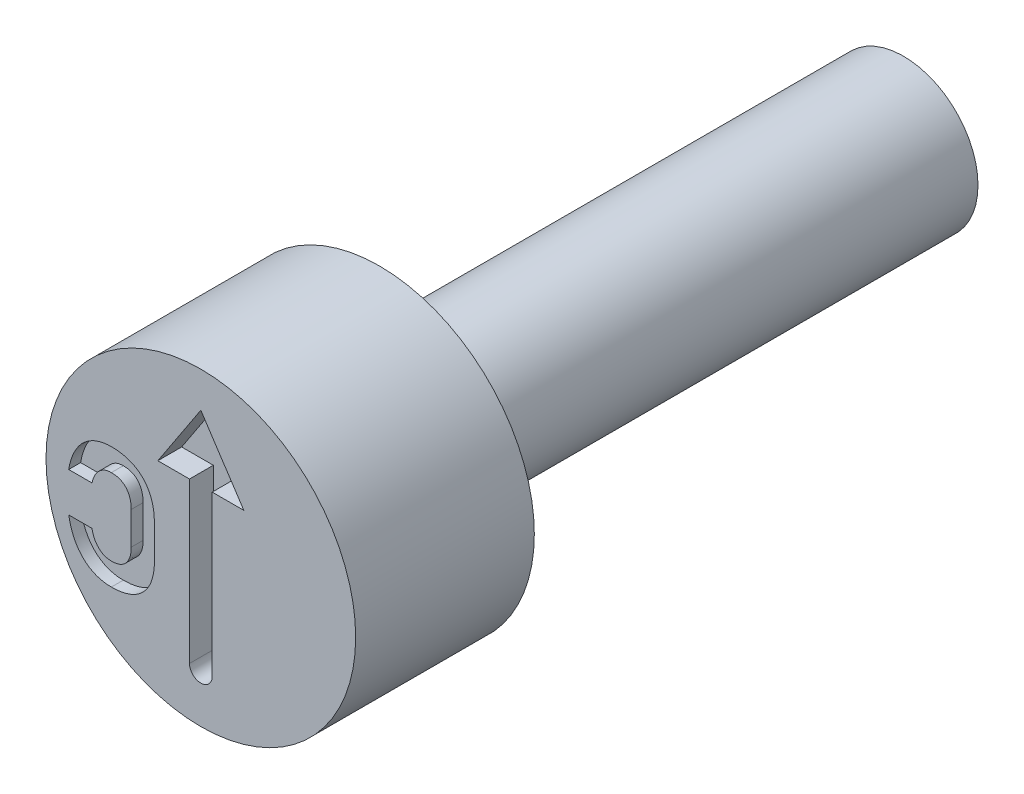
from build123d import *

# Parameters (mm, degrees)
CUT_EXTRUDE4_DEPTH = 0.4
CUT_EXTRUDE5_DEPTH = 0.2


with BuildPart() as part:
    # Sketch2 → Revolve1 (revolve)
    with BuildSketch(Plane(origin=(0, 0, 0), x_dir=(0, 0, -1), z_dir=(1, 0, 0)), mode=Mode.PRIVATE) as revolve1_sk:
        Polygon((0, 2.6), (0, 0), (11.8, 0), (11.8, 1.25), (3, 1.25), (3, 2.6), align=None)
    revolve(revolve1_sk.sketch.rotate(Axis((0, 0, -0.403888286), (0, 0, -1)), 90), axis=Axis((0, 0, -0.403888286), (0, 0, -1)))

    # Sketch3 → Cut-Extrude4 (cut)
    with BuildSketch(Plane.XY):
        with BuildLine():
            Line((0.190473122, 0.906351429), (0.190473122, -1.776161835))
            ThreePointArc((0.190473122, -1.776161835), (0, -1.966634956), (-0.190473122, -1.776161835))
            Line((-0.190473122, -1.776161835), (-0.190473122, 0.906351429))
            Line((-0.190473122, 0.906351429), (-0.721917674, 0.906351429))
            Line((-0.721917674, 0.906351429), (0, 2.002115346))
            Line((0, 2.002115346), (0.721917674, 0.906351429))
            Line((0.721917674, 0.906351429), (0.190473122, 0.906351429))
        make_face()
    extrude(amount=-CUT_EXTRUDE4_DEPTH, mode=Mode.SUBTRACT)

    # Sketch4 → Cut-Extrude5 (cut)
    with BuildSketch(Plane.XY):
        with BuildLine():
            add(Edge.make_bspline(
                [(-1.502384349, -1.320786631), (-1.483764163, -1.320585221), (-1.447020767, -1.320187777), (-1.392992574, -1.316052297), (-1.340868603, -1.309139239), (-1.290933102, -1.299390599), (-1.24304813, -1.287092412), (-1.197008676, -1.272556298), (-1.153257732, -1.254561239), (-1.111370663, -1.234154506), (-1.071937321, -1.211057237), (-1.035041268, -1.185077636), (-1.000316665, -1.157030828), (-0.968027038, -1.12635444), (-0.938205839, -1.093227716), (-0.910683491, -1.057613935), (-0.886025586, -1.019285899), (-0.863468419, -0.978760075), (-0.843399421, -0.935925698), (-0.826460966, -0.890578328), (-0.811775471, -0.843218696), (-0.799490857, -0.793854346), (-0.79008528, -0.742260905), (-0.783815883, -0.688477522), (-0.779469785, -0.632453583), (-0.779111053, -0.594350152), (-0.778928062, -0.574913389)],
                knots=[0, 0, 0, 0, 1.134237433, 2.238201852, 3.298772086, 4.336057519, 5.335809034, 6.309558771, 7.274828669, 8.21507465, 9.146315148, 10.055631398, 10.961815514, 11.863452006, 12.765999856, 13.674901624, 14.60241943, 15.539819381, 16.498894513, 17.481225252, 18.486546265, 19.518401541, 20.578551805, 21.679128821, 22.816111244, 24, 24, 24, 24], degree=3))
            Line((-0.778928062, -0.574913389), (-0.778928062, -0.026309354))
            add(Edge.make_bspline(
                [(-0.778928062, -0.026309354), (-0.779111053, -0.006872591), (-0.779469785, 0.031230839), (-0.783815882, 0.08725478), (-0.790085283, 0.141038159), (-0.799490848, 0.192631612), (-0.811775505, 0.241995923), (-0.826460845, 0.289355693), (-0.843399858, 0.334702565), (-0.863466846, 0.377538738), (-0.886031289, 0.418058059), (-0.910662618, 0.456409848), (-0.938343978, 0.492017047), (-0.967881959, 0.525533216), (-1.000334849, 0.556200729), (-1.035040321, 0.584258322), (-1.071922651, 0.610274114), (-1.111484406, 0.633241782), (-1.153130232, 0.654287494), (-1.197107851, 0.671997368), (-1.242957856, 0.687228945), (-1.290947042, 0.699349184), (-1.340864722, 0.70915077), (-1.392993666, 0.716049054), (-1.447020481, 0.720188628), (-1.483764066, 0.720585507), (-1.502384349, 0.720786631)],
                knots=[0, 0, 0, 0, 1.183277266, 2.319672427, 3.419680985, 4.479283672, 5.510605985, 6.515407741, 7.497231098, 8.455810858, 9.392726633, 10.319765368, 11.22819768, 12.136441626, 13.037612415, 13.943328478, 14.852175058, 15.782934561, 16.726365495, 17.691136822, 18.666946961, 19.666182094, 20.70293176, 21.7629542, 22.866348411, 24, 24, 24, 24], degree=3))
            add(Edge.make_bspline(
                [(-1.502384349, 0.720786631), (-1.533025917, 0.719966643), (-1.593091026, 0.718359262), (-1.680390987, 0.702220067), (-1.762830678, 0.67709328), (-1.839928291, 0.641264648), (-1.911442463, 0.596059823), (-1.976535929, 0.541059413), (-2.035186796, 0.476983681), (-2.086888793, 0.403570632), (-2.131789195, 0.321844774), (-2.168752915, 0.231796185), (-2.19875649, 0.134096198), (-2.212073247, 0.065546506), (-2.218911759, 0.030344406)],
                knots=[0, 0, 0, 0, 1.00806925, 1.976066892, 2.912865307, 3.839664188, 4.766819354, 5.690806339, 6.637604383, 7.619531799, 8.640729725, 9.701744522, 10.819784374, 12, 12, 12, 12], degree=3))
            Line((-2.218911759, 0.030344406), (-1.828449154, 0.030344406))
            add(Edge.make_bspline(
                [(-1.828449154, 0.030344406), (-1.824510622, 0.046320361), (-1.816846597, 0.077408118), (-1.801066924, 0.121633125), (-1.783123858, 0.16259737), (-1.761179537, 0.199324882), (-1.737290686, 0.232702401), (-1.710349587, 0.261619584), (-1.680945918, 0.286556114), (-1.649306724, 0.307180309), (-1.615518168, 0.32398868), (-1.579426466, 0.335112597), (-1.541529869, 0.342376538), (-1.515597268, 0.343302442), (-1.502384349, 0.3437742)],
                knots=[0, 0, 0, 0, 1.203096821, 2.341117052, 3.431111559, 4.469295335, 5.465369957, 6.42892467, 7.35290722, 8.279239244, 9.186115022, 10.104036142, 11.033987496, 12, 12, 12, 12], degree=3))
            add(Edge.make_bspline(
                [(-1.502384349, 0.3437742), (-1.48537812, 0.34317884), (-1.452538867, 0.342029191), (-1.404965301, 0.334539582), (-1.361631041, 0.320430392), (-1.321930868, 0.301713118), (-1.286466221, 0.277470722), (-1.255617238, 0.247751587), (-1.229368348, 0.212959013), (-1.207249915, 0.173691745), (-1.190147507, 0.129616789), (-1.178114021, 0.081277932), (-1.170667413, 0.028808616), (-1.169825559, -0.007534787), (-1.169390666, -0.026309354)],
                knots=[0, 0, 0, 0, 1.082677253, 2.090664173, 3.053339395, 3.973921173, 4.875832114, 5.774919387, 6.688160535, 7.640683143, 8.634736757, 9.687648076, 10.805466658, 12, 12, 12, 12], degree=3))
            Line((-1.169390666, -0.026309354), (-1.169390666, -0.574913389))
            add(Edge.make_bspline(
                [(-1.169390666, -0.574913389), (-1.169830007, -0.59368675), (-1.170680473, -0.630027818), (-1.178048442, -0.682382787), (-1.190238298, -0.730541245), (-1.207150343, -0.774421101), (-1.229365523, -0.81339615), (-1.255747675, -0.847781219), (-1.286449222, -0.877493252), (-1.321946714, -0.901667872), (-1.36154594, -0.920577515), (-1.405095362, -0.933869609), (-1.45247894, -0.942213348), (-1.485365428, -0.943241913), (-1.502384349, -0.9437742)],
                knots=[0, 0, 0, 0, 1.196920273, 2.316972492, 3.363591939, 4.359631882, 5.306515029, 6.214703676, 7.115587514, 8.019300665, 8.94172196, 9.903709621, 10.915159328, 12, 12, 12, 12], degree=3))
            add(Edge.make_bspline(
                [(-1.502384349, -0.9437742), (-1.515855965, -0.943243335), (-1.542279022, -0.942202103), (-1.580880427, -0.935827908), (-1.617224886, -0.924080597), (-1.651557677, -0.908252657), (-1.683627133, -0.887803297), (-1.712519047, -0.862536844), (-1.739430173, -0.833776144), (-1.763381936, -0.800584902), (-1.784614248, -0.763442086), (-1.802370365, -0.722333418), (-1.817783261, -0.677716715), (-1.824821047, -0.646189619), (-1.828449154, -0.629936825)],
                knots=[0, 0, 0, 0, 0.981077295, 1.924272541, 2.837745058, 3.753838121, 4.670304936, 5.59622504, 6.54113043, 7.532377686, 8.569122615, 9.649813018, 10.788435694, 12, 12, 12, 12], degree=3))
            Line((-1.828449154, -0.629936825), (-2.218911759, -0.629936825))
            add(Edge.make_bspline(
                [(-2.218911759, -0.629936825), (-2.211946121, -0.665278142), (-2.198403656, -0.733988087), (-2.167971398, -0.831835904), (-2.130468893, -0.921736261), (-2.085838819, -1.003554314), (-2.03380909, -1.076481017), (-1.975624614, -1.140789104), (-1.910793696, -1.195935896), (-1.839449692, -1.241367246), (-1.762414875, -1.27708329), (-1.680110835, -1.302165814), (-1.592961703, -1.318392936), (-1.533027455, -1.319976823), (-1.502384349, -1.320786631)],
                knots=[0, 0, 0, 0, 1.185884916, 2.305575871, 3.368634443, 4.390138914, 5.368714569, 6.312778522, 7.23993122, 8.163588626, 9.090665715, 10.027745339, 10.991628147, 12, 12, 12, 12], degree=3))
        make_face()
    extrude(amount=-CUT_EXTRUDE5_DEPTH, mode=Mode.SUBTRACT)


solid = part.part
